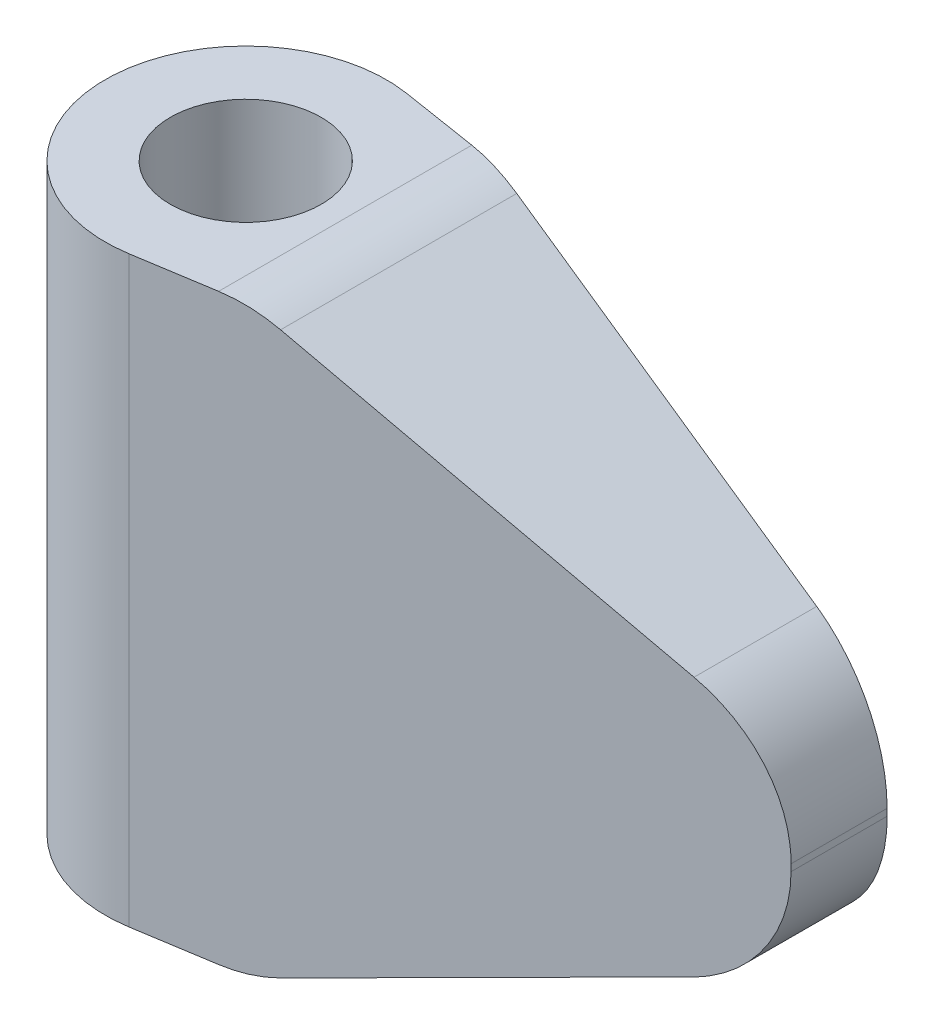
ISO-10303-21;
HEADER;
FILE_DESCRIPTION(('STEP AP214'),'2;1');
FILE_NAME('part.step','',(''),(''),'','','');
FILE_SCHEMA(('AUTOMOTIVE_DESIGN { 1 0 10303 214 1 1 1 1 }'));
ENDSEC;
DATA;
#1=APPLICATION_CONTEXT('core data for automotive mechanical design processes');
#2=APPLICATION_PROTOCOL_DEFINITION('international standard','automotive_design',2000,#1);
#3=PRODUCT_CONTEXT('',#1,'mechanical');
#4=PRODUCT('Part','Part','',(#3));
#5=PRODUCT_RELATED_PRODUCT_CATEGORY('part','',(#4));
#6=PRODUCT_DEFINITION_FORMATION('','',#4);
#7=PRODUCT_DEFINITION_CONTEXT('part definition',#1,'design');
#8=PRODUCT_DEFINITION('design','',#6,#7);
#9=PRODUCT_DEFINITION_SHAPE('','',#8);
#10=(LENGTH_UNIT() NAMED_UNIT(*) SI_UNIT(.MILLI.,.METRE.));
#11=(NAMED_UNIT(*) PLANE_ANGLE_UNIT() SI_UNIT($,.RADIAN.));
#12=(NAMED_UNIT(*) SI_UNIT($,.STERADIAN.) SOLID_ANGLE_UNIT());
#13=UNCERTAINTY_MEASURE_WITH_UNIT(LENGTH_MEASURE(1.E-05),#10,'distance_accuracy_value','');
#14=(GEOMETRIC_REPRESENTATION_CONTEXT(3) GLOBAL_UNCERTAINTY_ASSIGNED_CONTEXT((#13)) GLOBAL_UNIT_ASSIGNED_CONTEXT((#10,
#11,#12)) REPRESENTATION_CONTEXT('',''));
#15=CARTESIAN_POINT('',(0.,0.,0.));
#16=DIRECTION('',(0.,0.,1.));
#17=DIRECTION('',(1.,0.,0.));
#18=AXIS2_PLACEMENT_3D('',#15,#16,#17);
#19=CARTESIAN_POINT('',(0.,42.5,0.));
#20=DIRECTION('',(0.,1.,0.));
#21=DIRECTION('',(0.,0.,1.));
#22=AXIS2_PLACEMENT_3D('',#19,#20,#21);
#23=PLANE('',#22);
#24=CARTESIAN_POINT('',(0.,42.5,0.));
#25=DIRECTION('',(0.,1.,0.));
#26=DIRECTION('',(0.,0.,1.));
#27=AXIS2_PLACEMENT_3D('',#24,#25,#26);
#28=CIRCLE('',#27,11.);
#29=CARTESIAN_POINT('',(0.,42.5,11.));
#30=VERTEX_POINT('',#29);
#31=EDGE_CURVE('E156',#30,#30,#28,.T.);
#32=ORIENTED_EDGE('',*,*,#31,.F.);
#33=EDGE_LOOP('',(#32));
#34=FACE_BOUND('',#33,.T.);
#35=DIRECTION('',(0.987586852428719,0.,-0.157073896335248));
#36=VECTOR('',#35,1.);
#37=CARTESIAN_POINT('',(3.22001487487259,42.5,20.2455304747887));
#38=LINE('',#37,#36);
#39=CARTESIAN_POINT('',(3.22001487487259,42.5,20.2455304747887));
#40=VERTEX_POINT('',#39);
#41=CARTESIAN_POINT('',(14.5,42.5,18.4514693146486));
#42=VERTEX_POINT('',#41);
#43=EDGE_CURVE('E165',#40,#42,#38,.T.);
#44=ORIENTED_EDGE('',*,*,#43,.T.);
#45=DIRECTION('',(0.,0.,1.));
#46=VECTOR('',#45,1.);
#47=CARTESIAN_POINT('',(14.5,42.5,-20.5));
#48=LINE('',#47,#46);
#49=CARTESIAN_POINT('',(14.5,42.5,-18.4514693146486));
#50=VERTEX_POINT('',#49);
#51=EDGE_CURVE('E127',#50,#42,#48,.T.);
#52=ORIENTED_EDGE('',*,*,#51,.F.);
#53=DIRECTION('',(-0.987586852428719,0.,-0.157073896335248));
#54=VECTOR('',#53,1.);
#55=CARTESIAN_POINT('',(3.22001487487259,42.5,-20.2455304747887));
#56=LINE('',#55,#54);
#57=CARTESIAN_POINT('',(3.22001487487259,42.5,-20.2455304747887));
#58=VERTEX_POINT('',#57);
#59=EDGE_CURVE('E169',#50,#58,#56,.T.);
#60=ORIENTED_EDGE('',*,*,#59,.T.);
#61=CARTESIAN_POINT('',(0.,42.5,0.));
#62=DIRECTION('',(0.,1.,0.));
#63=DIRECTION('',(0.,0.,1.));
#64=AXIS2_PLACEMENT_3D('',#61,#62,#63);
#65=CIRCLE('',#64,20.5);
#66=EDGE_CURVE('E162',#58,#40,#65,.T.);
#67=ORIENTED_EDGE('',*,*,#66,.T.);
#68=EDGE_LOOP('',(#44,#52,#60,#67));
#69=FACE_BOUND('',#68,.T.);
#70=ADVANCED_FACE('F43',(#34,#69),#23,.T.);
#71=CARTESIAN_POINT('',(0.,-42.5,0.));
#72=DIRECTION('',(0.,1.,0.));
#73=DIRECTION('',(0.,0.,1.));
#74=AXIS2_PLACEMENT_3D('',#71,#72,#73);
#75=PLANE('',#74);
#76=CARTESIAN_POINT('',(0.,-42.5,0.));
#77=DIRECTION('',(0.,1.,0.));
#78=DIRECTION('',(0.,0.,1.));
#79=AXIS2_PLACEMENT_3D('',#76,#77,#78);
#80=CIRCLE('',#79,11.);
#81=CARTESIAN_POINT('',(0.,-42.5,11.));
#82=VERTEX_POINT('',#81);
#83=EDGE_CURVE('E155',#82,#82,#80,.T.);
#84=ORIENTED_EDGE('',*,*,#83,.T.);
#85=EDGE_LOOP('',(#84));
#86=FACE_BOUND('',#85,.T.);
#87=DIRECTION('',(0.,0.,1.));
#88=VECTOR('',#87,1.);
#89=CARTESIAN_POINT('',(14.5,-42.5,-20.5));
#90=LINE('',#89,#88);
#91=CARTESIAN_POINT('',(14.5,-42.5,-18.4514693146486));
#92=VERTEX_POINT('',#91);
#93=CARTESIAN_POINT('',(14.5,-42.5,18.4514693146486));
#94=VERTEX_POINT('',#93);
#95=EDGE_CURVE('E211',#92,#94,#90,.T.);
#96=ORIENTED_EDGE('',*,*,#95,.T.);
#97=DIRECTION('',(0.987586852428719,0.,-0.157073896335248));
#98=VECTOR('',#97,1.);
#99=CARTESIAN_POINT('',(3.22001487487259,-42.5,20.2455304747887));
#100=LINE('',#99,#98);
#101=CARTESIAN_POINT('',(3.22001487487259,-42.5,20.2455304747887));
#102=VERTEX_POINT('',#101);
#103=EDGE_CURVE('E174',#102,#94,#100,.T.);
#104=ORIENTED_EDGE('',*,*,#103,.F.);
#105=CARTESIAN_POINT('',(0.,-42.5,0.));
#106=DIRECTION('',(0.,1.,0.));
#107=DIRECTION('',(0.,0.,1.));
#108=AXIS2_PLACEMENT_3D('',#105,#106,#107);
#109=CIRCLE('',#108,20.5);
#110=CARTESIAN_POINT('',(3.22001487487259,-42.5,-20.2455304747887));
#111=VERTEX_POINT('',#110);
#112=EDGE_CURVE('E159',#111,#102,#109,.T.);
#113=ORIENTED_EDGE('',*,*,#112,.F.);
#114=DIRECTION('',(-0.987586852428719,0.,-0.157073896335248));
#115=VECTOR('',#114,1.);
#116=CARTESIAN_POINT('',(3.22001487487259,-42.5,-20.2455304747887));
#117=LINE('',#116,#115);
#118=EDGE_CURVE('E166',#92,#111,#117,.T.);
#119=ORIENTED_EDGE('',*,*,#118,.F.);
#120=EDGE_LOOP('',(#96,#104,#113,#119));
#121=FACE_BOUND('',#120,.T.);
#122=ADVANCED_FACE('F215',(#86,#121),#75,.F.);
#123=CARTESIAN_POINT('',(3.22001487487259,42.5,20.2455304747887));
#124=DIRECTION('',(-0.157073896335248,0.,-0.987586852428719));
#125=DIRECTION('',(-0.987586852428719,0.,0.157073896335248));
#126=AXIS2_PLACEMENT_3D('',#123,#124,#125);
#127=PLANE('',#126);
#128=DIRECTION('',(-0.911243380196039,0.385526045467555,0.144931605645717));
#129=VECTOR('',#128,1.);
#130=CARTESIAN_POINT('',(5.49951239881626,48.0241973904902,19.8829805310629));
#131=LINE('',#130,#129);
#132=CARTESIAN_POINT('',(74.2927998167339,18.9193450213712,8.94153303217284));
#133=VERTEX_POINT('',#132);
#134=CARTESIAN_POINT('',(22.292799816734,40.9193450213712,17.2120386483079));
#135=VERTEX_POINT('',#134);
#136=EDGE_CURVE('E144',#133,#135,#131,.T.);
#137=ORIENTED_EDGE('',*,*,#136,.T.);
#138=CARTESIAN_POINT('',(14.5,22.5,18.4514693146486));
#139=DIRECTION('',(-0.157073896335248,0.,-0.987586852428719));
#140=DIRECTION('',(-0.987586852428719,0.,0.157073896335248));
#141=AXIS2_PLACEMENT_3D('',#138,#139,#140);
#142=ELLIPSE('',#141,20.2513834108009,20.);
#143=EDGE_CURVE('E152',#135,#42,#142,.F.);
#144=ORIENTED_EDGE('',*,*,#143,.T.);
#145=ORIENTED_EDGE('',*,*,#43,.F.);
#146=DIRECTION('',(0.,-1.,0.));
#147=VECTOR('',#146,1.);
#148=CARTESIAN_POINT('',(3.22001487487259,42.5,20.2455304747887));
#149=LINE('',#148,#147);
#150=EDGE_CURVE('E184',#40,#102,#149,.T.);
#151=ORIENTED_EDGE('',*,*,#150,.T.);
#152=ORIENTED_EDGE('',*,*,#103,.T.);
#153=CARTESIAN_POINT('',(14.5,-22.5,18.4514693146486));
#154=DIRECTION('',(-0.157073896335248,0.,-0.987586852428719));
#155=DIRECTION('',(-0.987586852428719,0.,0.157073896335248));
#156=AXIS2_PLACEMENT_3D('',#153,#154,#155);
#157=ELLIPSE('',#156,20.2513834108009,20.);
#158=CARTESIAN_POINT('',(22.292799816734,-40.9193450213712,17.2120386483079));
#159=VERTEX_POINT('',#158);
#160=EDGE_CURVE('E142',#94,#159,#157,.F.);
#161=ORIENTED_EDGE('',*,*,#160,.T.);
#162=DIRECTION('',(0.911243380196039,0.385526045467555,-0.144931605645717));
#163=VECTOR('',#162,1.);
#164=CARTESIAN_POINT('',(35.3606972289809,-35.3906191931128,15.1336132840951));
#165=LINE('',#164,#163);
#166=CARTESIAN_POINT('',(74.292799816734,-18.9193450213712,8.94153303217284));
#167=VERTEX_POINT('',#166);
#168=EDGE_CURVE('E126',#159,#167,#165,.T.);
#169=ORIENTED_EDGE('',*,*,#168,.T.);
#170=CARTESIAN_POINT('',(66.5,-0.5,10.1809636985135));
#171=DIRECTION('',(-0.157073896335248,0.,-0.987586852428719));
#172=DIRECTION('',(-0.987586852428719,0.,0.157073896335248));
#173=AXIS2_PLACEMENT_3D('',#170,#171,#172);
#174=ELLIPSE('',#173,20.2513834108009,20.);
#175=CARTESIAN_POINT('',(86.5,-0.5,7.));
#176=VERTEX_POINT('',#175);
#177=EDGE_CURVE('E118',#167,#176,#174,.F.);
#178=ORIENTED_EDGE('',*,*,#177,.T.);
#179=DIRECTION('',(0.,-1.,0.));
#180=VECTOR('',#179,1.);
#181=CARTESIAN_POINT('',(86.5,42.5,7.));
#182=LINE('',#181,#180);
#183=CARTESIAN_POINT('',(86.5,0.500000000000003,7.));
#184=VERTEX_POINT('',#183);
#185=EDGE_CURVE('E182',#184,#176,#182,.T.);
#186=ORIENTED_EDGE('',*,*,#185,.F.);
#187=CARTESIAN_POINT('',(66.5,0.5,10.1809636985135));
#188=DIRECTION('',(-0.157073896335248,0.,-0.987586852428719));
#189=DIRECTION('',(-0.987586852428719,0.,0.157073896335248));
#190=AXIS2_PLACEMENT_3D('',#187,#188,#189);
#191=ELLIPSE('',#190,20.2513834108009,20.);
#192=EDGE_CURVE('E149',#184,#133,#191,.F.);
#193=ORIENTED_EDGE('',*,*,#192,.T.);
#194=EDGE_LOOP('',(#137,#144,#145,#151,#152,#161,#169,#178,#186,#193));
#195=FACE_BOUND('',#194,.T.);
#196=ADVANCED_FACE('F140',(#195),#127,.F.);
#197=CARTESIAN_POINT('',(86.5,42.5,-7.));
#198=DIRECTION('',(-1.,0.,0.));
#199=DIRECTION('',(0.,0.,1.));
#200=AXIS2_PLACEMENT_3D('',#197,#198,#199);
#201=PLANE('',#200);
#202=DIRECTION('',(0.,0.,1.));
#203=VECTOR('',#202,1.);
#204=CARTESIAN_POINT('',(86.5,0.500000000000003,-20.5));
#205=LINE('',#204,#203);
#206=CARTESIAN_POINT('',(86.5,0.500000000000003,-7.));
#207=VERTEX_POINT('',#206);
#208=EDGE_CURVE('E204',#207,#184,#205,.T.);
#209=ORIENTED_EDGE('',*,*,#208,.T.);
#210=ORIENTED_EDGE('',*,*,#185,.T.);
#211=DIRECTION('',(0.,0.,1.));
#212=VECTOR('',#211,1.);
#213=CARTESIAN_POINT('',(86.5,-0.5,-20.5));
#214=LINE('',#213,#212);
#215=CARTESIAN_POINT('',(86.5,-0.5,-7.));
#216=VERTEX_POINT('',#215);
#217=EDGE_CURVE('E121',#216,#176,#214,.T.);
#218=ORIENTED_EDGE('',*,*,#217,.F.);
#219=DIRECTION('',(0.,-1.,0.));
#220=VECTOR('',#219,1.);
#221=CARTESIAN_POINT('',(86.5,42.5,-7.));
#222=LINE('',#221,#220);
#223=EDGE_CURVE('E179',#207,#216,#222,.T.);
#224=ORIENTED_EDGE('',*,*,#223,.F.);
#225=EDGE_LOOP('',(#209,#210,#218,#224));
#226=FACE_BOUND('',#225,.T.);
#227=ADVANCED_FACE('F203',(#226),#201,.F.);
#228=CARTESIAN_POINT('',(3.22001487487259,42.5,-20.2455304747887));
#229=DIRECTION('',(-0.157073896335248,0.,0.987586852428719));
#230=DIRECTION('',(0.987586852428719,0.,0.157073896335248));
#231=AXIS2_PLACEMENT_3D('',#228,#229,#230);
#232=PLANE('',#231);
#233=ORIENTED_EDGE('',*,*,#59,.F.);
#234=CARTESIAN_POINT('',(14.5,22.5,-18.4514693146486));
#235=DIRECTION('',(-0.157073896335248,0.,0.987586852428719));
#236=DIRECTION('',(0.987586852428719,0.,0.157073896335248));
#237=AXIS2_PLACEMENT_3D('',#234,#235,#236);
#238=ELLIPSE('',#237,20.2513834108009,20.);
#239=CARTESIAN_POINT('',(22.292799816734,40.9193450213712,-17.2120386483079));
#240=VERTEX_POINT('',#239);
#241=EDGE_CURVE('E11',#50,#240,#238,.F.);
#242=ORIENTED_EDGE('',*,*,#241,.T.);
#243=DIRECTION('',(0.911243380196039,-0.385526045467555,0.144931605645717));
#244=VECTOR('',#243,1.);
#245=CARTESIAN_POINT('',(5.49951239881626,48.0241973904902,-19.8829805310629));
#246=LINE('',#245,#244);
#247=CARTESIAN_POINT('',(74.292799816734,18.9193450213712,-8.94153303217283));
#248=VERTEX_POINT('',#247);
#249=EDGE_CURVE('E193',#240,#248,#246,.T.);
#250=ORIENTED_EDGE('',*,*,#249,.T.);
#251=CARTESIAN_POINT('',(66.5,0.5,-10.1809636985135));
#252=DIRECTION('',(-0.157073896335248,0.,0.987586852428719));
#253=DIRECTION('',(0.987586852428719,0.,0.157073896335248));
#254=AXIS2_PLACEMENT_3D('',#251,#252,#253);
#255=ELLIPSE('',#254,20.2513834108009,20.);
#256=EDGE_CURVE('E51',#248,#207,#255,.F.);
#257=ORIENTED_EDGE('',*,*,#256,.T.);
#258=ORIENTED_EDGE('',*,*,#223,.T.);
#259=CARTESIAN_POINT('',(66.5,-0.5,-10.1809636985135));
#260=DIRECTION('',(-0.157073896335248,0.,0.987586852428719));
#261=DIRECTION('',(0.987586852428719,0.,0.157073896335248));
#262=AXIS2_PLACEMENT_3D('',#259,#260,#261);
#263=ELLIPSE('',#262,20.2513834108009,20.);
#264=CARTESIAN_POINT('',(74.292799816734,-18.9193450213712,-8.94153303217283));
#265=VERTEX_POINT('',#264);
#266=EDGE_CURVE('E187',#216,#265,#263,.F.);
#267=ORIENTED_EDGE('',*,*,#266,.T.);
#268=DIRECTION('',(-0.911243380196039,-0.385526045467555,-0.144931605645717));
#269=VECTOR('',#268,1.);
#270=CARTESIAN_POINT('',(35.3606972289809,-35.3906191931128,-15.1336132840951));
#271=LINE('',#270,#269);
#272=CARTESIAN_POINT('',(22.292799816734,-40.9193450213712,-17.2120386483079));
#273=VERTEX_POINT('',#272);
#274=EDGE_CURVE('E134',#265,#273,#271,.T.);
#275=ORIENTED_EDGE('',*,*,#274,.T.);
#276=CARTESIAN_POINT('',(14.5,-22.5,-18.4514693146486));
#277=DIRECTION('',(-0.157073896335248,0.,0.987586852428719));
#278=DIRECTION('',(0.987586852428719,0.,0.157073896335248));
#279=AXIS2_PLACEMENT_3D('',#276,#277,#278);
#280=ELLIPSE('',#279,20.2513834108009,20.);
#281=EDGE_CURVE('E190',#273,#92,#280,.F.);
#282=ORIENTED_EDGE('',*,*,#281,.T.);
#283=ORIENTED_EDGE('',*,*,#118,.T.);
#284=DIRECTION('',(0.,-1.,0.));
#285=VECTOR('',#284,1.);
#286=CARTESIAN_POINT('',(3.22001487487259,42.5,-20.2455304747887));
#287=LINE('',#286,#285);
#288=EDGE_CURVE('E171',#58,#111,#287,.T.);
#289=ORIENTED_EDGE('',*,*,#288,.F.);
#290=EDGE_LOOP('',(#233,#242,#250,#257,#258,#267,#275,#282,#283,#289));
#291=FACE_BOUND('',#290,.T.);
#292=ADVANCED_FACE('F199',(#291),#232,.F.);
#293=CARTESIAN_POINT('',(0.,42.5,0.));
#294=DIRECTION('',(0.,-1.,0.));
#295=DIRECTION('',(0.,0.,-1.));
#296=AXIS2_PLACEMENT_3D('',#293,#294,#295);
#297=CYLINDRICAL_SURFACE('',#296,20.5);
#298=ORIENTED_EDGE('',*,*,#112,.T.);
#299=ORIENTED_EDGE('',*,*,#150,.F.);
#300=ORIENTED_EDGE('',*,*,#66,.F.);
#301=ORIENTED_EDGE('',*,*,#288,.T.);
#302=EDGE_LOOP('',(#298,#299,#300,#301));
#303=FACE_BOUND('',#302,.T.);
#304=ADVANCED_FACE('F45',(#303),#297,.T.);
#305=CARTESIAN_POINT('',(0.,42.5,0.));
#306=DIRECTION('',(0.,-1.,0.));
#307=DIRECTION('',(0.,0.,-1.));
#308=AXIS2_PLACEMENT_3D('',#305,#306,#307);
#309=CYLINDRICAL_SURFACE('',#308,11.);
#310=ORIENTED_EDGE('',*,*,#31,.T.);
#311=EDGE_LOOP('',(#310));
#312=FACE_BOUND('',#311,.T.);
#313=ORIENTED_EDGE('',*,*,#83,.F.);
#314=EDGE_LOOP('',(#313));
#315=FACE_BOUND('',#314,.T.);
#316=ADVANCED_FACE('F224',(#312,#315),#309,.F.);
#317=CARTESIAN_POINT('',(14.5,-22.5,-20.5));
#318=DIRECTION('',(0.,0.,1.));
#319=DIRECTION('',(1.,0.,0.));
#320=AXIS2_PLACEMENT_3D('',#317,#318,#319);
#321=CYLINDRICAL_SURFACE('',#320,20.);
#322=ORIENTED_EDGE('',*,*,#95,.F.);
#323=ORIENTED_EDGE('',*,*,#281,.F.);
#324=DIRECTION('',(0.,0.,1.));
#325=VECTOR('',#324,1.);
#326=CARTESIAN_POINT('',(22.292799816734,-40.9193450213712,-20.5));
#327=LINE('',#326,#325);
#328=EDGE_CURVE('E136',#273,#159,#327,.T.);
#329=ORIENTED_EDGE('',*,*,#328,.T.);
#330=ORIENTED_EDGE('',*,*,#160,.F.);
#331=EDGE_LOOP('',(#322,#323,#329,#330));
#332=FACE_BOUND('',#331,.T.);
#333=ADVANCED_FACE('F222',(#332),#321,.T.);
#334=CARTESIAN_POINT('',(22.292799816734,-40.9193450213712,-20.5));
#335=DIRECTION('',(-0.389639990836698,0.920967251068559,0.));
#336=DIRECTION('',(-0.920967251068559,-0.389639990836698,0.));
#337=AXIS2_PLACEMENT_3D('',#334,#335,#336);
#338=PLANE('',#337);
#339=ORIENTED_EDGE('',*,*,#328,.F.);
#340=ORIENTED_EDGE('',*,*,#274,.F.);
#341=DIRECTION('',(0.,0.,1.));
#342=VECTOR('',#341,1.);
#343=CARTESIAN_POINT('',(74.292799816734,-18.9193450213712,-20.5));
#344=LINE('',#343,#342);
#345=EDGE_CURVE('E66',#265,#167,#344,.T.);
#346=ORIENTED_EDGE('',*,*,#345,.T.);
#347=ORIENTED_EDGE('',*,*,#168,.F.);
#348=EDGE_LOOP('',(#339,#340,#346,#347));
#349=FACE_BOUND('',#348,.T.);
#350=ADVANCED_FACE('F131',(#349),#338,.F.);
#351=CARTESIAN_POINT('',(66.5,-0.5,-20.5));
#352=DIRECTION('',(0.,0.,1.));
#353=DIRECTION('',(1.,0.,0.));
#354=AXIS2_PLACEMENT_3D('',#351,#352,#353);
#355=CYLINDRICAL_SURFACE('',#354,20.);
#356=ORIENTED_EDGE('',*,*,#345,.F.);
#357=ORIENTED_EDGE('',*,*,#266,.F.);
#358=ORIENTED_EDGE('',*,*,#217,.T.);
#359=ORIENTED_EDGE('',*,*,#177,.F.);
#360=EDGE_LOOP('',(#356,#357,#358,#359));
#361=FACE_BOUND('',#360,.T.);
#362=ADVANCED_FACE('F119',(#361),#355,.T.);
#363=CARTESIAN_POINT('',(14.5,22.5,-20.5));
#364=DIRECTION('',(0.,0.,1.));
#365=DIRECTION('',(1.,0.,0.));
#366=AXIS2_PLACEMENT_3D('',#363,#364,#365);
#367=CYLINDRICAL_SURFACE('',#366,20.);
#368=DIRECTION('',(0.,0.,1.));
#369=VECTOR('',#368,1.);
#370=CARTESIAN_POINT('',(22.292799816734,40.9193450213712,-20.5));
#371=LINE('',#370,#369);
#372=EDGE_CURVE('E205',#240,#135,#371,.T.);
#373=ORIENTED_EDGE('',*,*,#372,.F.);
#374=ORIENTED_EDGE('',*,*,#241,.F.);
#375=ORIENTED_EDGE('',*,*,#51,.T.);
#376=ORIENTED_EDGE('',*,*,#143,.F.);
#377=EDGE_LOOP('',(#373,#374,#375,#376));
#378=FACE_BOUND('',#377,.T.);
#379=ADVANCED_FACE('F332',(#378),#367,.T.);
#380=CARTESIAN_POINT('',(66.5,0.5,-20.5));
#381=DIRECTION('',(0.,0.,1.));
#382=DIRECTION('',(1.,0.,0.));
#383=AXIS2_PLACEMENT_3D('',#380,#381,#382);
#384=CYLINDRICAL_SURFACE('',#383,20.);
#385=ORIENTED_EDGE('',*,*,#208,.F.);
#386=ORIENTED_EDGE('',*,*,#256,.F.);
#387=DIRECTION('',(0.,0.,1.));
#388=VECTOR('',#387,1.);
#389=CARTESIAN_POINT('',(74.292799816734,18.9193450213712,-20.5));
#390=LINE('',#389,#388);
#391=EDGE_CURVE('E58',#248,#133,#390,.T.);
#392=ORIENTED_EDGE('',*,*,#391,.T.);
#393=ORIENTED_EDGE('',*,*,#192,.F.);
#394=EDGE_LOOP('',(#385,#386,#392,#393));
#395=FACE_BOUND('',#394,.T.);
#396=ADVANCED_FACE('F343',(#395),#384,.T.);
#397=CARTESIAN_POINT('',(22.292799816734,40.9193450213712,-20.5));
#398=DIRECTION('',(-0.389639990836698,-0.920967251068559,0.));
#399=DIRECTION('',(0.920967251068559,-0.389639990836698,0.));
#400=AXIS2_PLACEMENT_3D('',#397,#398,#399);
#401=PLANE('',#400);
#402=ORIENTED_EDGE('',*,*,#391,.F.);
#403=ORIENTED_EDGE('',*,*,#249,.F.);
#404=ORIENTED_EDGE('',*,*,#372,.T.);
#405=ORIENTED_EDGE('',*,*,#136,.F.);
#406=EDGE_LOOP('',(#402,#403,#404,#405));
#407=FACE_BOUND('',#406,.T.);
#408=ADVANCED_FACE('F355',(#407),#401,.F.);
#409=CLOSED_SHELL('',(#70,#122,#196,#227,#292,#304,#316,#333,#350,#362,#379,#396,#408));
#410=MANIFOLD_SOLID_BREP('B2',#409);
#411=ADVANCED_BREP_SHAPE_REPRESENTATION('',(#18,#410),#14);
#412=SHAPE_DEFINITION_REPRESENTATION(#9,#411);
ENDSEC;
END-ISO-10303-21;
